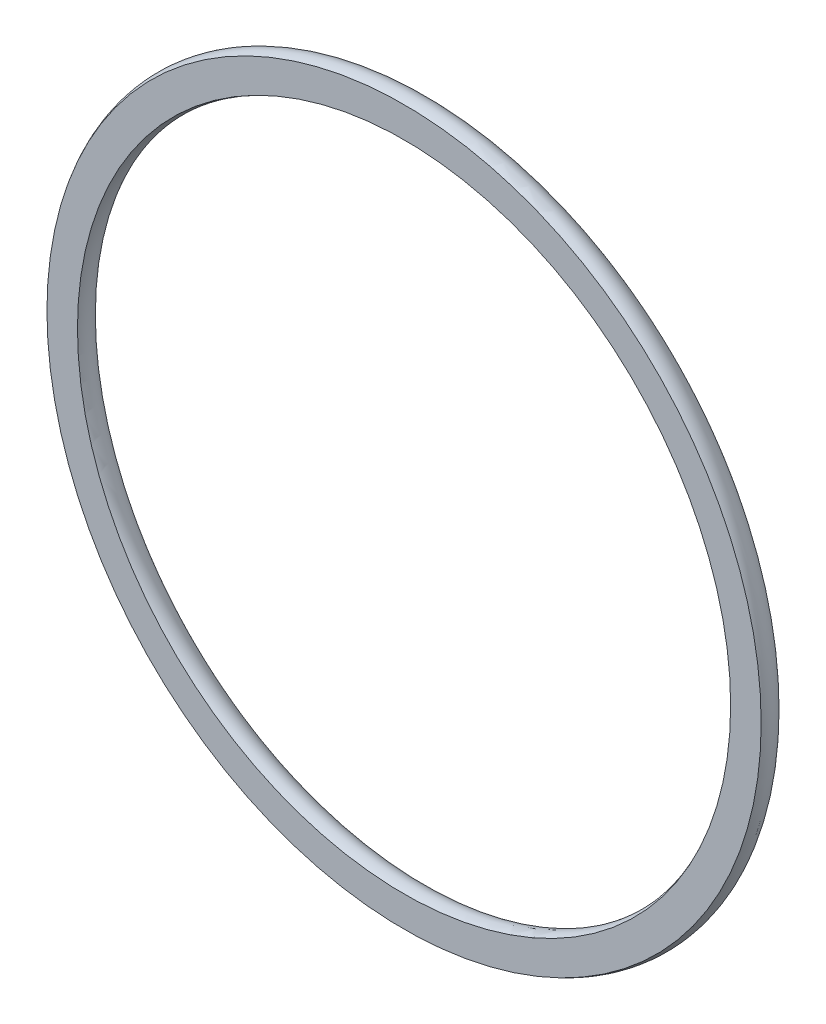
ISO-10303-21;
HEADER;
FILE_DESCRIPTION(('STEP AP214'),'2;1');
FILE_NAME('part.step','',(''),(''),'','','');
FILE_SCHEMA(('AUTOMOTIVE_DESIGN { 1 0 10303 214 1 1 1 1 }'));
ENDSEC;
DATA;
#1=APPLICATION_CONTEXT('core data for automotive mechanical design processes');
#2=APPLICATION_PROTOCOL_DEFINITION('international standard','automotive_design',2000,#1);
#3=PRODUCT_CONTEXT('',#1,'mechanical');
#4=PRODUCT('Part','Part','',(#3));
#5=PRODUCT_RELATED_PRODUCT_CATEGORY('part','',(#4));
#6=PRODUCT_DEFINITION_FORMATION('','',#4);
#7=PRODUCT_DEFINITION_CONTEXT('part definition',#1,'design');
#8=PRODUCT_DEFINITION('design','',#6,#7);
#9=PRODUCT_DEFINITION_SHAPE('','',#8);
#10=(LENGTH_UNIT() NAMED_UNIT(*) SI_UNIT(.MILLI.,.METRE.));
#11=(NAMED_UNIT(*) PLANE_ANGLE_UNIT() SI_UNIT($,.RADIAN.));
#12=(NAMED_UNIT(*) SI_UNIT($,.STERADIAN.) SOLID_ANGLE_UNIT());
#13=UNCERTAINTY_MEASURE_WITH_UNIT(LENGTH_MEASURE(1.E-05),#10,'distance_accuracy_value','');
#14=(GEOMETRIC_REPRESENTATION_CONTEXT(3) GLOBAL_UNCERTAINTY_ASSIGNED_CONTEXT((#13)) GLOBAL_UNIT_ASSIGNED_CONTEXT((#10,
#11,#12)) REPRESENTATION_CONTEXT('',''));
#15=CARTESIAN_POINT('',(0.,0.,0.));
#16=DIRECTION('',(0.,0.,1.));
#17=DIRECTION('',(1.,0.,0.));
#18=AXIS2_PLACEMENT_3D('',#15,#16,#17);
#19=CARTESIAN_POINT('',(0.,0.,0.));
#20=DIRECTION('',(0.,0.,1.));
#21=DIRECTION('',(1.,0.,0.));
#22=AXIS2_PLACEMENT_3D('',#19,#20,#21);
#23=TOROIDAL_SURFACE('',#22,17.4117,0.889);
#24=CARTESIAN_POINT('',(0.,0.,0.4318));
#25=DIRECTION('',(0.,0.,1.));
#26=DIRECTION('',(1.,0.,0.));
#27=AXIS2_PLACEMENT_3D('',#24,#25,#26);
#28=CIRCLE('',#27,16.6346094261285);
#29=CARTESIAN_POINT('',(16.6346094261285,0.,0.4318));
#30=VERTEX_POINT('',#29);
#31=EDGE_CURVE('E44',#30,#30,#28,.F.);
#32=ORIENTED_EDGE('',*,*,#31,.F.);
#33=EDGE_LOOP('',(#32));
#34=FACE_BOUND('',#33,.T.);
#35=CARTESIAN_POINT('',(0.,0.,0.4318));
#36=DIRECTION('',(0.,0.,-1.));
#37=DIRECTION('',(-1.,0.,0.));
#38=AXIS2_PLACEMENT_3D('',#35,#36,#37);
#39=CIRCLE('',#38,18.1887905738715);
#40=CARTESIAN_POINT('',(-18.1887905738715,0.,0.4318));
#41=VERTEX_POINT('',#40);
#42=EDGE_CURVE('E10',#41,#41,#39,.F.);
#43=ORIENTED_EDGE('',*,*,#42,.F.);
#44=EDGE_LOOP('',(#43));
#45=FACE_BOUND('',#44,.T.);
#46=ADVANCED_FACE('F37',(#34,#45),#23,.T.);
#47=CARTESIAN_POINT('',(0.,0.,0.4318));
#48=DIRECTION('',(0.,0.,-1.));
#49=DIRECTION('',(-1.,0.,0.));
#50=AXIS2_PLACEMENT_3D('',#47,#48,#49);
#51=PLANE('',#50);
#52=ORIENTED_EDGE('',*,*,#42,.T.);
#53=EDGE_LOOP('',(#52));
#54=FACE_BOUND('',#53,.T.);
#55=ORIENTED_EDGE('',*,*,#31,.T.);
#56=EDGE_LOOP('',(#55));
#57=FACE_BOUND('',#56,.T.);
#58=ADVANCED_FACE('F51',(#54,#57),#51,.F.);
#59=CLOSED_SHELL('',(#46,#58));
#60=MANIFOLD_SOLID_BREP('B2',#59);
#61=ADVANCED_BREP_SHAPE_REPRESENTATION('',(#18,#60),#14);
#62=SHAPE_DEFINITION_REPRESENTATION(#9,#61);
ENDSEC;
END-ISO-10303-21;
